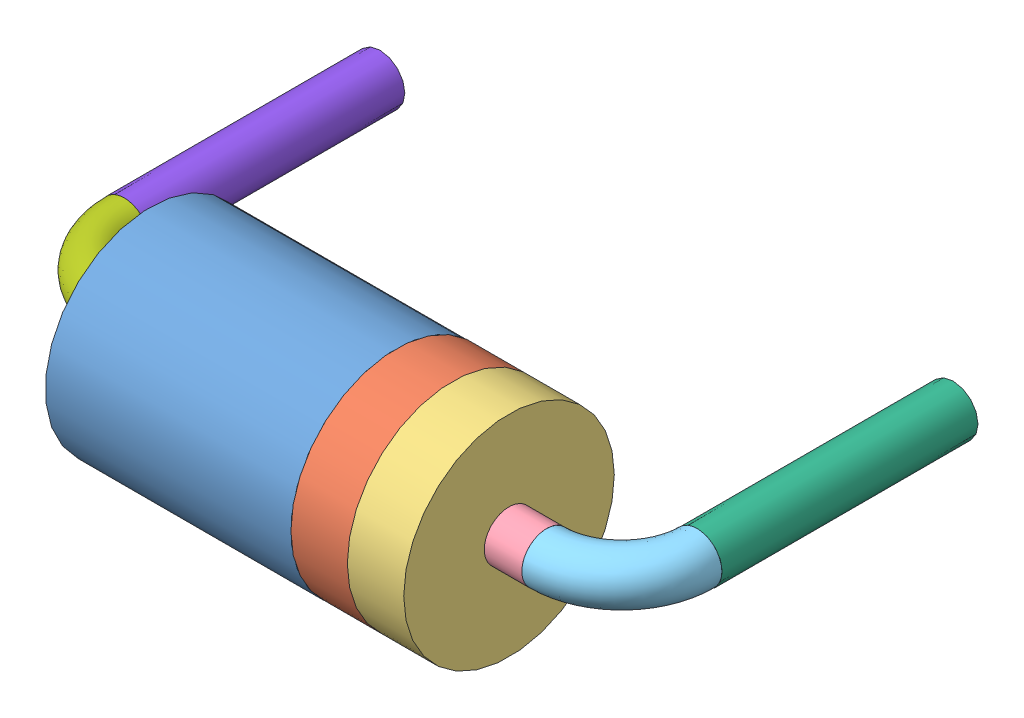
SolidWorks assembly User Library-DO-201AD.SLDASM, configuration Default (file format 4400). Lengths in mm.
Overall size (16.62 5.6 11.6).
9 component instances, 9 part files, 0 mates.
Components (placement in the parent):
- User Library-DO-201AD_Cylinder-1: User Library-DO-201AD_Cylinder.sldprt [Default] at origin size (6.53 5.6 5.6)
- User Library-DO-201AD_Cylinder001-1: User Library-DO-201AD_Cylinder001.sldprt [Default] at origin size (1.5 5.6 5.6)
- User Library-DO-201AD_Cylinder002-1: User Library-DO-201AD_Cylinder002.sldprt [Default] at origin size (1.5 5.6 5.6)
- User Library-DO-201AD_Cylinder003-1: User Library-DO-201AD_Cylinder003.sldprt [Default] at origin size (1 1.32 1.32)
- User Library-DO-201AD_Torus-1: User Library-DO-201AD_Torus.sldprt [Default] at origin size (2.7 1.39 2.7)
- User Library-DO-201AD_Cylinder004-1: User Library-DO-201AD_Cylinder004.sldprt [Default] at origin size (1.32 1.32 6.8)
- User Library-DO-201AD_Torus001-1: User Library-DO-201AD_Torus001.sldprt [Default] at origin size (2.7 1.39 2.7)
- User Library-DO-201AD_Cylinder005-1: User Library-DO-201AD_Cylinder005.sldprt [Default] at origin size (1.32 1.32 6.8)
- User Library-DO-201AD_Cylinder006-1: User Library-DO-201AD_Cylinder006.sldprt [Default] at origin size (1 1.32 1.32)
